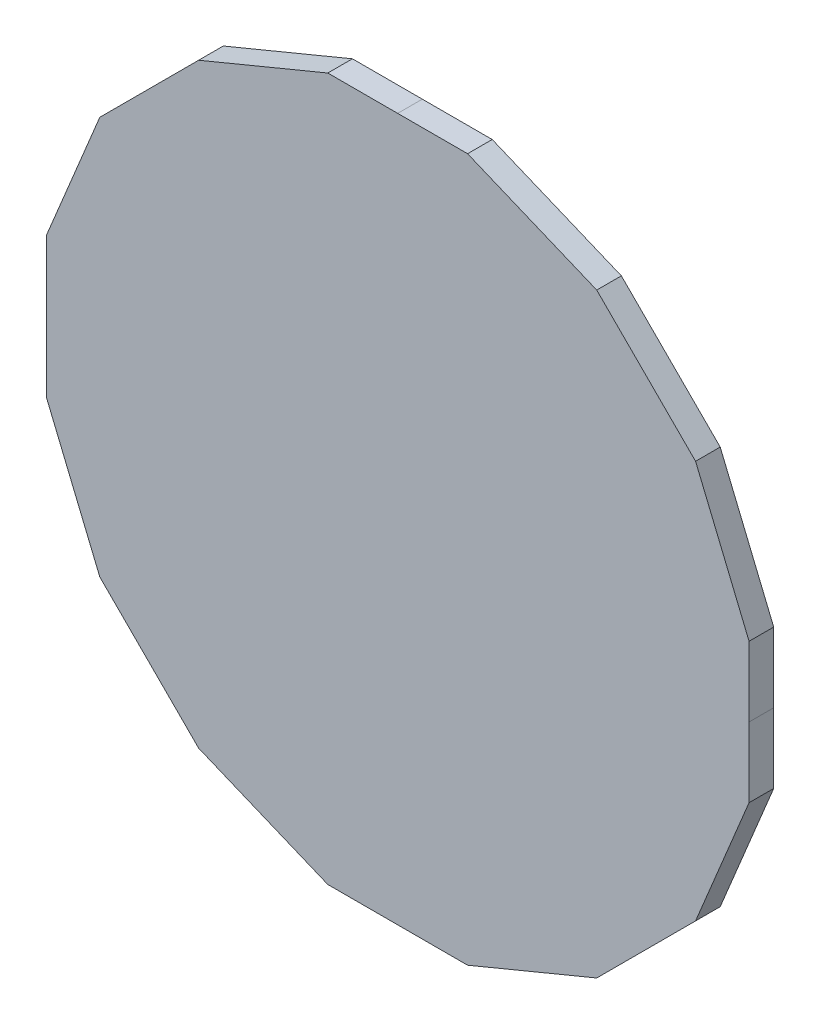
ISO-10303-21;
HEADER;
FILE_DESCRIPTION(('STEP AP214'),'2;1');
FILE_NAME('part.step','',(''),(''),'','','');
FILE_SCHEMA(('AUTOMOTIVE_DESIGN { 1 0 10303 214 1 1 1 1 }'));
ENDSEC;
DATA;
#1=APPLICATION_CONTEXT('core data for automotive mechanical design processes');
#2=APPLICATION_PROTOCOL_DEFINITION('international standard','automotive_design',2000,#1);
#3=PRODUCT_CONTEXT('',#1,'mechanical');
#4=PRODUCT('Part','Part','',(#3));
#5=PRODUCT_RELATED_PRODUCT_CATEGORY('part','',(#4));
#6=PRODUCT_DEFINITION_FORMATION('','',#4);
#7=PRODUCT_DEFINITION_CONTEXT('part definition',#1,'design');
#8=PRODUCT_DEFINITION('design','',#6,#7);
#9=PRODUCT_DEFINITION_SHAPE('','',#8);
#10=(LENGTH_UNIT() NAMED_UNIT(*) SI_UNIT(.MILLI.,.METRE.));
#11=(NAMED_UNIT(*) PLANE_ANGLE_UNIT() SI_UNIT($,.RADIAN.));
#12=(NAMED_UNIT(*) SI_UNIT($,.STERADIAN.) SOLID_ANGLE_UNIT());
#13=UNCERTAINTY_MEASURE_WITH_UNIT(LENGTH_MEASURE(1.E-05),#10,'distance_accuracy_value','');
#14=(GEOMETRIC_REPRESENTATION_CONTEXT(3) GLOBAL_UNCERTAINTY_ASSIGNED_CONTEXT((#13)) GLOBAL_UNIT_ASSIGNED_CONTEXT((#10,
#11,#12)) REPRESENTATION_CONTEXT('',''));
#15=CARTESIAN_POINT('',(0.,0.,0.));
#16=DIRECTION('',(0.,0.,1.));
#17=DIRECTION('',(1.,0.,0.));
#18=AXIS2_PLACEMENT_3D('',#15,#16,#17);
#19=CARTESIAN_POINT('',(-6.703281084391E-07,-6.703280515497E-07,0.0350012));
#20=DIRECTION('',(0.,0.,1.));
#21=DIRECTION('',(1.,0.,0.));
#22=AXIS2_PLACEMENT_3D('',#19,#20,#21);
#23=PLANE('',#22);
#24=DIRECTION('',(0.,-1.,0.));
#25=VECTOR('',#24,1.);
#26=CARTESIAN_POINT('',(-0.499491,0.,0.0350012));
#27=LINE('',#26,#25);
#28=CARTESIAN_POINT('',(-0.499491,0.,0.0350012));
#29=VERTEX_POINT('',#28);
#30=CARTESIAN_POINT('',(-0.499491,-0.09935717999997,0.0350012));
#31=VERTEX_POINT('',#30);
#32=EDGE_CURVE('E166',#29,#31,#27,.T.);
#33=ORIENTED_EDGE('',*,*,#32,.T.);
#34=DIRECTION('',(0.382682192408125,-0.923880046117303,0.));
#35=VECTOR('',#34,1.);
#36=CARTESIAN_POINT('',(-0.499491,-0.09935717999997,0.0350012));
#37=LINE('',#36,#35);
#38=CARTESIAN_POINT('',(-0.42344848,-0.28294076,0.0350012));
#39=VERTEX_POINT('',#38);
#40=EDGE_CURVE('E183',#31,#39,#37,.T.);
#41=ORIENTED_EDGE('',*,*,#40,.T.);
#42=DIRECTION('',(0.707106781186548,-0.707106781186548,0.));
#43=VECTOR('',#42,1.);
#44=CARTESIAN_POINT('',(-0.42344848,-0.28294076,0.0350012));
#45=LINE('',#44,#43);
#46=CARTESIAN_POINT('',(-0.28294076,-0.42344848,0.0350012));
#47=VERTEX_POINT('',#46);
#48=EDGE_CURVE('E245',#39,#47,#45,.T.);
#49=ORIENTED_EDGE('',*,*,#48,.T.);
#50=DIRECTION('',(0.923880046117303,-0.382682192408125,0.));
#51=VECTOR('',#50,1.);
#52=CARTESIAN_POINT('',(-0.28294076,-0.42344848,0.0350012));
#53=LINE('',#52,#51);
#54=CARTESIAN_POINT('',(-0.09935718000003,-0.499491,0.0350012));
#55=VERTEX_POINT('',#54);
#56=EDGE_CURVE('E188',#47,#55,#53,.T.);
#57=ORIENTED_EDGE('',*,*,#56,.T.);
#58=DIRECTION('',(1.,0.,0.));
#59=VECTOR('',#58,1.);
#60=CARTESIAN_POINT('',(-0.09935718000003,-0.499491,0.0350012));
#61=LINE('',#60,#59);
#62=CARTESIAN_POINT('',(0.,-0.499491,0.0350012));
#63=VERTEX_POINT('',#62);
#64=EDGE_CURVE('E258',#55,#63,#61,.T.);
#65=ORIENTED_EDGE('',*,*,#64,.T.);
#66=DIRECTION('',(1.,0.,0.));
#67=VECTOR('',#66,1.);
#68=CARTESIAN_POINT('',(0.,-0.499491,0.0350012));
#69=LINE('',#68,#67);
#70=CARTESIAN_POINT('',(0.09935463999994,-0.499491,0.0350012));
#71=VERTEX_POINT('',#70);
#72=EDGE_CURVE('E217',#63,#71,#69,.T.);
#73=ORIENTED_EDGE('',*,*,#72,.T.);
#74=DIRECTION('',(0.923880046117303,0.382682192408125,0.));
#75=VECTOR('',#74,1.);
#76=CARTESIAN_POINT('',(0.09935463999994,-0.499491,0.0350012));
#77=LINE('',#76,#75);
#78=CARTESIAN_POINT('',(0.28293822,-0.42344848,0.0350012));
#79=VERTEX_POINT('',#78);
#80=EDGE_CURVE('E200',#71,#79,#77,.T.);
#81=ORIENTED_EDGE('',*,*,#80,.T.);
#82=DIRECTION('',(0.707106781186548,0.707106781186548,0.));
#83=VECTOR('',#82,1.);
#84=CARTESIAN_POINT('',(0.28293822,-0.42344848,0.0350012));
#85=LINE('',#84,#83);
#86=CARTESIAN_POINT('',(0.42344594,-0.28294076,0.0350012));
#87=VERTEX_POINT('',#86);
#88=EDGE_CURVE('E288',#79,#87,#85,.T.);
#89=ORIENTED_EDGE('',*,*,#88,.T.);
#90=DIRECTION('',(0.382693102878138,0.923875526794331,0.));
#91=VECTOR('',#90,1.);
#92=CARTESIAN_POINT('',(0.42344594,-0.28294076,0.0350012));
#93=LINE('',#92,#91);
#94=CARTESIAN_POINT('',(0.499491,-0.09935717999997,0.0350012));
#95=VERTEX_POINT('',#94);
#96=EDGE_CURVE('E266',#87,#95,#93,.T.);
#97=ORIENTED_EDGE('',*,*,#96,.T.);
#98=DIRECTION('',(0.,1.,0.));
#99=VECTOR('',#98,1.);
#100=CARTESIAN_POINT('',(0.499491,-0.09935717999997,0.0350012));
#101=LINE('',#100,#99);
#102=CARTESIAN_POINT('',(0.499491,0.,0.0350012));
#103=VERTEX_POINT('',#102);
#104=EDGE_CURVE('E195',#95,#103,#101,.T.);
#105=ORIENTED_EDGE('',*,*,#104,.T.);
#106=DIRECTION('',(0.,1.,0.));
#107=VECTOR('',#106,1.);
#108=CARTESIAN_POINT('',(0.499491,0.,0.0350012));
#109=LINE('',#108,#107);
#110=CARTESIAN_POINT('',(0.499491,0.09935464,0.0350012));
#111=VERTEX_POINT('',#110);
#112=EDGE_CURVE('E213',#103,#111,#109,.T.);
#113=ORIENTED_EDGE('',*,*,#112,.T.);
#114=DIRECTION('',(-0.382693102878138,0.923875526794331,0.));
#115=VECTOR('',#114,1.);
#116=CARTESIAN_POINT('',(0.499491,0.09935464,0.0350012));
#117=LINE('',#116,#115);
#118=CARTESIAN_POINT('',(0.42344594,0.28293822,0.0350012));
#119=VERTEX_POINT('',#118);
#120=EDGE_CURVE('E314',#111,#119,#117,.T.);
#121=ORIENTED_EDGE('',*,*,#120,.T.);
#122=DIRECTION('',(-0.707106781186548,0.707106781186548,0.));
#123=VECTOR('',#122,1.);
#124=CARTESIAN_POINT('',(0.42344594,0.28293822,0.0350012));
#125=LINE('',#124,#123);
#126=CARTESIAN_POINT('',(0.28293822,0.42344594,0.0350012));
#127=VERTEX_POINT('',#126);
#128=EDGE_CURVE('E326',#119,#127,#125,.T.);
#129=ORIENTED_EDGE('',*,*,#128,.T.);
#130=DIRECTION('',(-0.923875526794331,0.382693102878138,0.));
#131=VECTOR('',#130,1.);
#132=CARTESIAN_POINT('',(0.28293822,0.42344594,0.0350012));
#133=LINE('',#132,#131);
#134=CARTESIAN_POINT('',(0.09935463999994,0.499491,0.0350012));
#135=VERTEX_POINT('',#134);
#136=EDGE_CURVE('E225',#127,#135,#133,.T.);
#137=ORIENTED_EDGE('',*,*,#136,.T.);
#138=DIRECTION('',(-1.,0.,0.));
#139=VECTOR('',#138,1.);
#140=CARTESIAN_POINT('',(0.09935463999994,0.499491,0.0350012));
#141=LINE('',#140,#139);
#142=CARTESIAN_POINT('',(0.,0.499491,0.0350012));
#143=VERTEX_POINT('',#142);
#144=EDGE_CURVE('E344',#135,#143,#141,.T.);
#145=ORIENTED_EDGE('',*,*,#144,.T.);
#146=DIRECTION('',(-1.,0.,0.));
#147=VECTOR('',#146,1.);
#148=CARTESIAN_POINT('',(0.,0.499491,0.0350012));
#149=LINE('',#148,#147);
#150=CARTESIAN_POINT('',(-0.09935718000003,0.499491,0.0350012));
#151=VERTEX_POINT('',#150);
#152=EDGE_CURVE('E356',#143,#151,#149,.T.);
#153=ORIENTED_EDGE('',*,*,#152,.T.);
#154=DIRECTION('',(-0.923875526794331,-0.382693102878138,0.));
#155=VECTOR('',#154,1.);
#156=CARTESIAN_POINT('',(-0.09935718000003,0.499491,0.0350012));
#157=LINE('',#156,#155);
#158=CARTESIAN_POINT('',(-0.28294076,0.42344594,0.0350012));
#159=VERTEX_POINT('',#158);
#160=EDGE_CURVE('E125',#151,#159,#157,.T.);
#161=ORIENTED_EDGE('',*,*,#160,.T.);
#162=DIRECTION('',(-0.707106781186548,-0.707106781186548,0.));
#163=VECTOR('',#162,1.);
#164=CARTESIAN_POINT('',(-0.28294076,0.42344594,0.0350012));
#165=LINE('',#164,#163);
#166=CARTESIAN_POINT('',(-0.42344848,0.28293822,0.0350012));
#167=VERTEX_POINT('',#166);
#168=EDGE_CURVE('E122',#159,#167,#165,.T.);
#169=ORIENTED_EDGE('',*,*,#168,.T.);
#170=DIRECTION('',(-0.382682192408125,-0.923880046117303,0.));
#171=VECTOR('',#170,1.);
#172=CARTESIAN_POINT('',(-0.42344848,0.28293822,0.0350012));
#173=LINE('',#172,#171);
#174=CARTESIAN_POINT('',(-0.499491,0.09935464,0.0350012));
#175=VERTEX_POINT('',#174);
#176=EDGE_CURVE('E110',#167,#175,#173,.T.);
#177=ORIENTED_EDGE('',*,*,#176,.T.);
#178=DIRECTION('',(0.,-1.,0.));
#179=VECTOR('',#178,1.);
#180=CARTESIAN_POINT('',(-0.499491,0.09935464,0.0350012));
#181=LINE('',#180,#179);
#182=EDGE_CURVE('E11',#175,#29,#181,.T.);
#183=ORIENTED_EDGE('',*,*,#182,.T.);
#184=EDGE_LOOP('',(#33,#41,#49,#57,#65,#73,#81,#89,#97,#105,#113,#121,#129,#137,#145,#153,#161,
#169,#177,#183));
#185=FACE_BOUND('',#184,.T.);
#186=ADVANCED_FACE('F17',(#185),#23,.T.);
#187=CARTESIAN_POINT('',(-6.703281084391E-07,-6.703280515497E-07,0.));
#188=DIRECTION('',(0.,0.,1.));
#189=DIRECTION('',(1.,0.,0.));
#190=AXIS2_PLACEMENT_3D('',#187,#188,#189);
#191=PLANE('',#190);
#192=DIRECTION('',(0.,-1.,0.));
#193=VECTOR('',#192,1.);
#194=CARTESIAN_POINT('',(-0.499491,0.09935464,0.));
#195=LINE('',#194,#193);
#196=CARTESIAN_POINT('',(-0.499491,0.09935464,0.));
#197=VERTEX_POINT('',#196);
#198=CARTESIAN_POINT('',(-0.499491,0.,0.));
#199=VERTEX_POINT('',#198);
#200=EDGE_CURVE('E27',#197,#199,#195,.T.);
#201=ORIENTED_EDGE('',*,*,#200,.F.);
#202=DIRECTION('',(-0.382682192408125,-0.923880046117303,0.));
#203=VECTOR('',#202,1.);
#204=CARTESIAN_POINT('',(-0.42344848,0.28293822,0.));
#205=LINE('',#204,#203);
#206=CARTESIAN_POINT('',(-0.42344848,0.28293822,0.));
#207=VERTEX_POINT('',#206);
#208=EDGE_CURVE('E130',#207,#197,#205,.T.);
#209=ORIENTED_EDGE('',*,*,#208,.F.);
#210=DIRECTION('',(-0.707106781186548,-0.707106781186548,0.));
#211=VECTOR('',#210,1.);
#212=CARTESIAN_POINT('',(-0.28294076,0.42344594,0.));
#213=LINE('',#212,#211);
#214=CARTESIAN_POINT('',(-0.28294076,0.42344594,0.));
#215=VERTEX_POINT('',#214);
#216=EDGE_CURVE('E133',#215,#207,#213,.T.);
#217=ORIENTED_EDGE('',*,*,#216,.F.);
#218=DIRECTION('',(-0.923875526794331,-0.382693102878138,0.));
#219=VECTOR('',#218,1.);
#220=CARTESIAN_POINT('',(-0.09935718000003,0.499491,0.));
#221=LINE('',#220,#219);
#222=CARTESIAN_POINT('',(-0.09935718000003,0.499491,0.));
#223=VERTEX_POINT('',#222);
#224=EDGE_CURVE('E359',#223,#215,#221,.T.);
#225=ORIENTED_EDGE('',*,*,#224,.F.);
#226=DIRECTION('',(-1.,0.,0.));
#227=VECTOR('',#226,1.);
#228=CARTESIAN_POINT('',(0.,0.499491,0.));
#229=LINE('',#228,#227);
#230=CARTESIAN_POINT('',(0.,0.499491,0.));
#231=VERTEX_POINT('',#230);
#232=EDGE_CURVE('E348',#231,#223,#229,.T.);
#233=ORIENTED_EDGE('',*,*,#232,.F.);
#234=DIRECTION('',(-1.,0.,0.));
#235=VECTOR('',#234,1.);
#236=CARTESIAN_POINT('',(0.09935463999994,0.499491,0.));
#237=LINE('',#236,#235);
#238=CARTESIAN_POINT('',(0.09935463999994,0.499491,0.));
#239=VERTEX_POINT('',#238);
#240=EDGE_CURVE('E220',#239,#231,#237,.T.);
#241=ORIENTED_EDGE('',*,*,#240,.F.);
#242=DIRECTION('',(-0.923875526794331,0.382693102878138,0.));
#243=VECTOR('',#242,1.);
#244=CARTESIAN_POINT('',(0.28293822,0.42344594,0.));
#245=LINE('',#244,#243);
#246=CARTESIAN_POINT('',(0.28293822,0.42344594,0.));
#247=VERTEX_POINT('',#246);
#248=EDGE_CURVE('E330',#247,#239,#245,.T.);
#249=ORIENTED_EDGE('',*,*,#248,.F.);
#250=DIRECTION('',(-0.707106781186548,0.707106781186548,0.));
#251=VECTOR('',#250,1.);
#252=CARTESIAN_POINT('',(0.42344594,0.28293822,0.));
#253=LINE('',#252,#251);
#254=CARTESIAN_POINT('',(0.42344594,0.28293822,0.));
#255=VERTEX_POINT('',#254);
#256=EDGE_CURVE('E318',#255,#247,#253,.T.);
#257=ORIENTED_EDGE('',*,*,#256,.F.);
#258=DIRECTION('',(-0.382693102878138,0.923875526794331,0.));
#259=VECTOR('',#258,1.);
#260=CARTESIAN_POINT('',(0.499491,0.09935464,0.));
#261=LINE('',#260,#259);
#262=CARTESIAN_POINT('',(0.499491,0.09935464,0.));
#263=VERTEX_POINT('',#262);
#264=EDGE_CURVE('E208',#263,#255,#261,.T.);
#265=ORIENTED_EDGE('',*,*,#264,.F.);
#266=DIRECTION('',(0.,1.,0.));
#267=VECTOR('',#266,1.);
#268=CARTESIAN_POINT('',(0.499491,0.,0.));
#269=LINE('',#268,#267);
#270=CARTESIAN_POINT('',(0.499491,0.,0.));
#271=VERTEX_POINT('',#270);
#272=EDGE_CURVE('E190',#271,#263,#269,.T.);
#273=ORIENTED_EDGE('',*,*,#272,.F.);
#274=DIRECTION('',(0.,1.,0.));
#275=VECTOR('',#274,1.);
#276=CARTESIAN_POINT('',(0.499491,-0.09935717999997,0.));
#277=LINE('',#276,#275);
#278=CARTESIAN_POINT('',(0.499491,-0.09935717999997,0.));
#279=VERTEX_POINT('',#278);
#280=EDGE_CURVE('E298',#279,#271,#277,.T.);
#281=ORIENTED_EDGE('',*,*,#280,.F.);
#282=DIRECTION('',(0.382693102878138,0.923875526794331,0.));
#283=VECTOR('',#282,1.);
#284=CARTESIAN_POINT('',(0.42344594,-0.28294076,0.));
#285=LINE('',#284,#283);
#286=CARTESIAN_POINT('',(0.42344594,-0.28294076,0.));
#287=VERTEX_POINT('',#286);
#288=EDGE_CURVE('E267',#287,#279,#285,.T.);
#289=ORIENTED_EDGE('',*,*,#288,.F.);
#290=DIRECTION('',(0.707106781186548,0.707106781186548,0.));
#291=VECTOR('',#290,1.);
#292=CARTESIAN_POINT('',(0.28293822,-0.42344848,0.));
#293=LINE('',#292,#291);
#294=CARTESIAN_POINT('',(0.28293822,-0.42344848,0.));
#295=VERTEX_POINT('',#294);
#296=EDGE_CURVE('E204',#295,#287,#293,.T.);
#297=ORIENTED_EDGE('',*,*,#296,.F.);
#298=DIRECTION('',(0.923880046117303,0.382682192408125,0.));
#299=VECTOR('',#298,1.);
#300=CARTESIAN_POINT('',(0.09935463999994,-0.499491,0.));
#301=LINE('',#300,#299);
#302=CARTESIAN_POINT('',(0.09935463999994,-0.499491,0.));
#303=VERTEX_POINT('',#302);
#304=EDGE_CURVE('E274',#303,#295,#301,.T.);
#305=ORIENTED_EDGE('',*,*,#304,.F.);
#306=DIRECTION('',(1.,0.,0.));
#307=VECTOR('',#306,1.);
#308=CARTESIAN_POINT('',(0.,-0.499491,0.));
#309=LINE('',#308,#307);
#310=CARTESIAN_POINT('',(0.,-0.499491,0.));
#311=VERTEX_POINT('',#310);
#312=EDGE_CURVE('E218',#311,#303,#309,.T.);
#313=ORIENTED_EDGE('',*,*,#312,.F.);
#314=DIRECTION('',(1.,0.,0.));
#315=VECTOR('',#314,1.);
#316=CARTESIAN_POINT('',(-0.09935718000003,-0.499491,0.));
#317=LINE('',#316,#315);
#318=CARTESIAN_POINT('',(-0.09935718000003,-0.499491,0.));
#319=VERTEX_POINT('',#318);
#320=EDGE_CURVE('E226',#319,#311,#317,.T.);
#321=ORIENTED_EDGE('',*,*,#320,.F.);
#322=DIRECTION('',(0.923880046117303,-0.382682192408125,0.));
#323=VECTOR('',#322,1.);
#324=CARTESIAN_POINT('',(-0.28294076,-0.42344848,0.));
#325=LINE('',#324,#323);
#326=CARTESIAN_POINT('',(-0.28294076,-0.42344848,0.));
#327=VERTEX_POINT('',#326);
#328=EDGE_CURVE('E189',#327,#319,#325,.T.);
#329=ORIENTED_EDGE('',*,*,#328,.F.);
#330=DIRECTION('',(0.707106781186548,-0.707106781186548,0.));
#331=VECTOR('',#330,1.);
#332=CARTESIAN_POINT('',(-0.42344848,-0.28294076,0.));
#333=LINE('',#332,#331);
#334=CARTESIAN_POINT('',(-0.42344848,-0.28294076,0.));
#335=VERTEX_POINT('',#334);
#336=EDGE_CURVE('E237',#335,#327,#333,.T.);
#337=ORIENTED_EDGE('',*,*,#336,.F.);
#338=DIRECTION('',(0.382682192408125,-0.923880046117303,0.));
#339=VECTOR('',#338,1.);
#340=CARTESIAN_POINT('',(-0.499491,-0.09935717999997,0.));
#341=LINE('',#340,#339);
#342=CARTESIAN_POINT('',(-0.499491,-0.09935717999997,0.));
#343=VERTEX_POINT('',#342);
#344=EDGE_CURVE('E168',#343,#335,#341,.T.);
#345=ORIENTED_EDGE('',*,*,#344,.F.);
#346=DIRECTION('',(0.,-1.,0.));
#347=VECTOR('',#346,1.);
#348=CARTESIAN_POINT('',(-0.499491,0.,0.));
#349=LINE('',#348,#347);
#350=EDGE_CURVE('E165',#199,#343,#349,.T.);
#351=ORIENTED_EDGE('',*,*,#350,.F.);
#352=EDGE_LOOP('',(#201,#209,#217,#225,#233,#241,#249,#257,#265,#273,#281,#289,#297,#305,#313,
#321,#329,#337,#345,#351));
#353=FACE_BOUND('',#352,.T.);
#354=ADVANCED_FACE('F19',(#353),#191,.F.);
#355=CARTESIAN_POINT('',(-0.499491,0.09935464,0.));
#356=DIRECTION('',(1.,0.,0.));
#357=DIRECTION('',(0.,1.,0.));
#358=AXIS2_PLACEMENT_3D('',#355,#356,#357);
#359=PLANE('',#358);
#360=ORIENTED_EDGE('',*,*,#200,.T.);
#361=DIRECTION('',(0.,0.,1.));
#362=VECTOR('',#361,1.);
#363=CARTESIAN_POINT('',(-0.499491,0.,0.));
#364=LINE('',#363,#362);
#365=EDGE_CURVE('E154',#199,#29,#364,.T.);
#366=ORIENTED_EDGE('',*,*,#365,.T.);
#367=ORIENTED_EDGE('',*,*,#182,.F.);
#368=DIRECTION('',(0.,0.,1.));
#369=VECTOR('',#368,1.);
#370=CARTESIAN_POINT('',(-0.499491,0.09935464,0.));
#371=LINE('',#370,#369);
#372=EDGE_CURVE('E117',#197,#175,#371,.T.);
#373=ORIENTED_EDGE('',*,*,#372,.F.);
#374=EDGE_LOOP('',(#360,#366,#367,#373));
#375=FACE_BOUND('',#374,.T.);
#376=ADVANCED_FACE('F152',(#375),#359,.F.);
#377=CARTESIAN_POINT('',(-0.42344848,0.28293822,0.));
#378=DIRECTION('',(0.923880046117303,-0.382682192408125,0.));
#379=DIRECTION('',(0.,0.,-1.));
#380=AXIS2_PLACEMENT_3D('',#377,#378,#379);
#381=PLANE('',#380);
#382=ORIENTED_EDGE('',*,*,#208,.T.);
#383=ORIENTED_EDGE('',*,*,#372,.T.);
#384=ORIENTED_EDGE('',*,*,#176,.F.);
#385=DIRECTION('',(0.,0.,1.));
#386=VECTOR('',#385,1.);
#387=CARTESIAN_POINT('',(-0.42344848,0.28293822,0.));
#388=LINE('',#387,#386);
#389=EDGE_CURVE('E115',#207,#167,#388,.T.);
#390=ORIENTED_EDGE('',*,*,#389,.F.);
#391=EDGE_LOOP('',(#382,#383,#384,#390));
#392=FACE_BOUND('',#391,.T.);
#393=ADVANCED_FACE('F113',(#392),#381,.F.);
#394=CARTESIAN_POINT('',(-0.28294076,0.42344594,0.));
#395=DIRECTION('',(0.707106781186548,-0.707106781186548,0.));
#396=DIRECTION('',(0.,0.,-1.));
#397=AXIS2_PLACEMENT_3D('',#394,#395,#396);
#398=PLANE('',#397);
#399=ORIENTED_EDGE('',*,*,#216,.T.);
#400=ORIENTED_EDGE('',*,*,#389,.T.);
#401=ORIENTED_EDGE('',*,*,#168,.F.);
#402=DIRECTION('',(0.,0.,1.));
#403=VECTOR('',#402,1.);
#404=CARTESIAN_POINT('',(-0.28294076,0.42344594,0.));
#405=LINE('',#404,#403);
#406=EDGE_CURVE('E363',#215,#159,#405,.T.);
#407=ORIENTED_EDGE('',*,*,#406,.F.);
#408=EDGE_LOOP('',(#399,#400,#401,#407));
#409=FACE_BOUND('',#408,.T.);
#410=ADVANCED_FACE('F132',(#409),#398,.F.);
#411=CARTESIAN_POINT('',(-0.09935718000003,0.499491,0.));
#412=DIRECTION('',(0.382693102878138,-0.923875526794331,0.));
#413=DIRECTION('',(0.,0.,-1.));
#414=AXIS2_PLACEMENT_3D('',#411,#412,#413);
#415=PLANE('',#414);
#416=ORIENTED_EDGE('',*,*,#224,.T.);
#417=ORIENTED_EDGE('',*,*,#406,.T.);
#418=ORIENTED_EDGE('',*,*,#160,.F.);
#419=DIRECTION('',(0.,0.,1.));
#420=VECTOR('',#419,1.);
#421=CARTESIAN_POINT('',(-0.09935718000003,0.499491,0.));
#422=LINE('',#421,#420);
#423=EDGE_CURVE('E352',#223,#151,#422,.T.);
#424=ORIENTED_EDGE('',*,*,#423,.F.);
#425=EDGE_LOOP('',(#416,#417,#418,#424));
#426=FACE_BOUND('',#425,.T.);
#427=ADVANCED_FACE('F613',(#426),#415,.F.);
#428=CARTESIAN_POINT('',(0.,0.499491,0.));
#429=DIRECTION('',(0.,-1.,0.));
#430=DIRECTION('',(0.,0.,-1.));
#431=AXIS2_PLACEMENT_3D('',#428,#429,#430);
#432=PLANE('',#431);
#433=ORIENTED_EDGE('',*,*,#232,.T.);
#434=ORIENTED_EDGE('',*,*,#423,.T.);
#435=ORIENTED_EDGE('',*,*,#152,.F.);
#436=DIRECTION('',(0.,0.,1.));
#437=VECTOR('',#436,1.);
#438=CARTESIAN_POINT('',(0.,0.499491,0.));
#439=LINE('',#438,#437);
#440=EDGE_CURVE('E224',#231,#143,#439,.T.);
#441=ORIENTED_EDGE('',*,*,#440,.F.);
#442=EDGE_LOOP('',(#433,#434,#435,#441));
#443=FACE_BOUND('',#442,.T.);
#444=ADVANCED_FACE('F585',(#443),#432,.F.);
#445=CARTESIAN_POINT('',(0.09935463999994,0.499491,0.));
#446=DIRECTION('',(0.,-1.,0.));
#447=DIRECTION('',(0.,0.,-1.));
#448=AXIS2_PLACEMENT_3D('',#445,#446,#447);
#449=PLANE('',#448);
#450=ORIENTED_EDGE('',*,*,#240,.T.);
#451=ORIENTED_EDGE('',*,*,#440,.T.);
#452=ORIENTED_EDGE('',*,*,#144,.F.);
#453=DIRECTION('',(0.,0.,1.));
#454=VECTOR('',#453,1.);
#455=CARTESIAN_POINT('',(0.09935463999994,0.499491,0.));
#456=LINE('',#455,#454);
#457=EDGE_CURVE('E334',#239,#135,#456,.T.);
#458=ORIENTED_EDGE('',*,*,#457,.F.);
#459=EDGE_LOOP('',(#450,#451,#452,#458));
#460=FACE_BOUND('',#459,.T.);
#461=ADVANCED_FACE('F579',(#460),#449,.F.);
#462=CARTESIAN_POINT('',(0.28293822,0.42344594,0.));
#463=DIRECTION('',(-0.382693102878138,-0.923875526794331,0.));
#464=DIRECTION('',(-0.923875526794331,0.382693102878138,0.));
#465=AXIS2_PLACEMENT_3D('',#462,#463,#464);
#466=PLANE('',#465);
#467=ORIENTED_EDGE('',*,*,#248,.T.);
#468=ORIENTED_EDGE('',*,*,#457,.T.);
#469=ORIENTED_EDGE('',*,*,#136,.F.);
#470=DIRECTION('',(0.,0.,1.));
#471=VECTOR('',#470,1.);
#472=CARTESIAN_POINT('',(0.28293822,0.42344594,0.));
#473=LINE('',#472,#471);
#474=EDGE_CURVE('E322',#247,#127,#473,.T.);
#475=ORIENTED_EDGE('',*,*,#474,.F.);
#476=EDGE_LOOP('',(#467,#468,#469,#475));
#477=FACE_BOUND('',#476,.T.);
#478=ADVANCED_FACE('F584',(#477),#466,.F.);
#479=CARTESIAN_POINT('',(0.42344594,0.28293822,0.));
#480=DIRECTION('',(-0.707106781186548,-0.707106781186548,0.));
#481=DIRECTION('',(-0.707106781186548,0.707106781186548,0.));
#482=AXIS2_PLACEMENT_3D('',#479,#480,#481);
#483=PLANE('',#482);
#484=ORIENTED_EDGE('',*,*,#256,.T.);
#485=ORIENTED_EDGE('',*,*,#474,.T.);
#486=ORIENTED_EDGE('',*,*,#128,.F.);
#487=DIRECTION('',(0.,0.,1.));
#488=VECTOR('',#487,1.);
#489=CARTESIAN_POINT('',(0.42344594,0.28293822,0.));
#490=LINE('',#489,#488);
#491=EDGE_CURVE('E212',#255,#119,#490,.T.);
#492=ORIENTED_EDGE('',*,*,#491,.F.);
#493=EDGE_LOOP('',(#484,#485,#486,#492));
#494=FACE_BOUND('',#493,.T.);
#495=ADVANCED_FACE('F676',(#494),#483,.F.);
#496=CARTESIAN_POINT('',(0.499491,0.09935464,0.));
#497=DIRECTION('',(-0.923875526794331,-0.382693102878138,0.));
#498=DIRECTION('',(-0.382693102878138,0.923875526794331,0.));
#499=AXIS2_PLACEMENT_3D('',#496,#497,#498);
#500=PLANE('',#499);
#501=ORIENTED_EDGE('',*,*,#264,.T.);
#502=ORIENTED_EDGE('',*,*,#491,.T.);
#503=ORIENTED_EDGE('',*,*,#120,.F.);
#504=DIRECTION('',(0.,0.,1.));
#505=VECTOR('',#504,1.);
#506=CARTESIAN_POINT('',(0.499491,0.09935464,0.));
#507=LINE('',#506,#505);
#508=EDGE_CURVE('E194',#263,#111,#507,.T.);
#509=ORIENTED_EDGE('',*,*,#508,.F.);
#510=EDGE_LOOP('',(#501,#502,#503,#509));
#511=FACE_BOUND('',#510,.T.);
#512=ADVANCED_FACE('F643',(#511),#500,.F.);
#513=CARTESIAN_POINT('',(0.499491,0.,0.));
#514=DIRECTION('',(-1.,0.,0.));
#515=DIRECTION('',(0.,0.,1.));
#516=AXIS2_PLACEMENT_3D('',#513,#514,#515);
#517=PLANE('',#516);
#518=ORIENTED_EDGE('',*,*,#272,.T.);
#519=ORIENTED_EDGE('',*,*,#508,.T.);
#520=ORIENTED_EDGE('',*,*,#112,.F.);
#521=DIRECTION('',(0.,0.,1.));
#522=VECTOR('',#521,1.);
#523=CARTESIAN_POINT('',(0.499491,0.,0.));
#524=LINE('',#523,#522);
#525=EDGE_CURVE('E198',#271,#103,#524,.T.);
#526=ORIENTED_EDGE('',*,*,#525,.F.);
#527=EDGE_LOOP('',(#518,#519,#520,#526));
#528=FACE_BOUND('',#527,.T.);
#529=ADVANCED_FACE('F637',(#528),#517,.F.);
#530=CARTESIAN_POINT('',(0.499491,-0.09935717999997,0.));
#531=DIRECTION('',(-1.,0.,0.));
#532=DIRECTION('',(0.,0.,1.));
#533=AXIS2_PLACEMENT_3D('',#530,#531,#532);
#534=PLANE('',#533);
#535=ORIENTED_EDGE('',*,*,#280,.T.);
#536=ORIENTED_EDGE('',*,*,#525,.T.);
#537=ORIENTED_EDGE('',*,*,#104,.F.);
#538=DIRECTION('',(0.,0.,1.));
#539=VECTOR('',#538,1.);
#540=CARTESIAN_POINT('',(0.499491,-0.09935717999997,0.));
#541=LINE('',#540,#539);
#542=EDGE_CURVE('E262',#279,#95,#541,.T.);
#543=ORIENTED_EDGE('',*,*,#542,.F.);
#544=EDGE_LOOP('',(#535,#536,#537,#543));
#545=FACE_BOUND('',#544,.T.);
#546=ADVANCED_FACE('F642',(#545),#534,.F.);
#547=CARTESIAN_POINT('',(0.42344594,-0.28294076,0.));
#548=DIRECTION('',(-0.923875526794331,0.382693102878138,0.));
#549=DIRECTION('',(0.,0.,1.));
#550=AXIS2_PLACEMENT_3D('',#547,#548,#549);
#551=PLANE('',#550);
#552=ORIENTED_EDGE('',*,*,#288,.T.);
#553=ORIENTED_EDGE('',*,*,#542,.T.);
#554=ORIENTED_EDGE('',*,*,#96,.F.);
#555=DIRECTION('',(0.,0.,1.));
#556=VECTOR('',#555,1.);
#557=CARTESIAN_POINT('',(0.42344594,-0.28294076,0.));
#558=LINE('',#557,#556);
#559=EDGE_CURVE('E284',#287,#87,#558,.T.);
#560=ORIENTED_EDGE('',*,*,#559,.F.);
#561=EDGE_LOOP('',(#552,#553,#554,#560));
#562=FACE_BOUND('',#561,.T.);
#563=ADVANCED_FACE('F653',(#562),#551,.F.);
#564=CARTESIAN_POINT('',(0.28293822,-0.42344848,0.));
#565=DIRECTION('',(-0.707106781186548,0.707106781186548,0.));
#566=DIRECTION('',(0.,0.,1.));
#567=AXIS2_PLACEMENT_3D('',#564,#565,#566);
#568=PLANE('',#567);
#569=ORIENTED_EDGE('',*,*,#296,.T.);
#570=ORIENTED_EDGE('',*,*,#559,.T.);
#571=ORIENTED_EDGE('',*,*,#88,.F.);
#572=DIRECTION('',(0.,0.,1.));
#573=VECTOR('',#572,1.);
#574=CARTESIAN_POINT('',(0.28293822,-0.42344848,0.));
#575=LINE('',#574,#573);
#576=EDGE_CURVE('E205',#295,#79,#575,.T.);
#577=ORIENTED_EDGE('',*,*,#576,.F.);
#578=EDGE_LOOP('',(#569,#570,#571,#577));
#579=FACE_BOUND('',#578,.T.);
#580=ADVANCED_FACE('F631',(#579),#568,.F.);
#581=CARTESIAN_POINT('',(0.09935463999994,-0.499491,0.));
#582=DIRECTION('',(-0.382682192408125,0.923880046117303,0.));
#583=DIRECTION('',(0.,0.,1.));
#584=AXIS2_PLACEMENT_3D('',#581,#582,#583);
#585=PLANE('',#584);
#586=ORIENTED_EDGE('',*,*,#304,.T.);
#587=ORIENTED_EDGE('',*,*,#576,.T.);
#588=ORIENTED_EDGE('',*,*,#80,.F.);
#589=DIRECTION('',(0.,0.,1.));
#590=VECTOR('',#589,1.);
#591=CARTESIAN_POINT('',(0.09935463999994,-0.499491,0.));
#592=LINE('',#591,#590);
#593=EDGE_CURVE('E214',#303,#71,#592,.T.);
#594=ORIENTED_EDGE('',*,*,#593,.F.);
#595=EDGE_LOOP('',(#586,#587,#588,#594));
#596=FACE_BOUND('',#595,.T.);
#597=ADVANCED_FACE('F622',(#596),#585,.F.);
#598=CARTESIAN_POINT('',(0.,-0.499491,0.));
#599=DIRECTION('',(0.,1.,0.));
#600=DIRECTION('',(1.,0.,0.));
#601=AXIS2_PLACEMENT_3D('',#598,#599,#600);
#602=PLANE('',#601);
#603=ORIENTED_EDGE('',*,*,#312,.T.);
#604=ORIENTED_EDGE('',*,*,#593,.T.);
#605=ORIENTED_EDGE('',*,*,#72,.F.);
#606=DIRECTION('',(0.,0.,1.));
#607=VECTOR('',#606,1.);
#608=CARTESIAN_POINT('',(0.,-0.499491,0.));
#609=LINE('',#608,#607);
#610=EDGE_CURVE('E230',#311,#63,#609,.T.);
#611=ORIENTED_EDGE('',*,*,#610,.F.);
#612=EDGE_LOOP('',(#603,#604,#605,#611));
#613=FACE_BOUND('',#612,.T.);
#614=ADVANCED_FACE('F604',(#613),#602,.F.);
#615=CARTESIAN_POINT('',(-0.09935718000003,-0.499491,0.));
#616=DIRECTION('',(0.,1.,0.));
#617=DIRECTION('',(1.,0.,0.));
#618=AXIS2_PLACEMENT_3D('',#615,#616,#617);
#619=PLANE('',#618);
#620=ORIENTED_EDGE('',*,*,#320,.T.);
#621=ORIENTED_EDGE('',*,*,#610,.T.);
#622=ORIENTED_EDGE('',*,*,#64,.F.);
#623=DIRECTION('',(0.,0.,1.));
#624=VECTOR('',#623,1.);
#625=CARTESIAN_POINT('',(-0.09935718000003,-0.499491,0.));
#626=LINE('',#625,#624);
#627=EDGE_CURVE('E184',#319,#55,#626,.T.);
#628=ORIENTED_EDGE('',*,*,#627,.F.);
#629=EDGE_LOOP('',(#620,#621,#622,#628));
#630=FACE_BOUND('',#629,.T.);
#631=ADVANCED_FACE('F595',(#630),#619,.F.);
#632=CARTESIAN_POINT('',(-0.28294076,-0.42344848,0.));
#633=DIRECTION('',(0.382682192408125,0.923880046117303,0.));
#634=DIRECTION('',(0.,0.,-1.));
#635=AXIS2_PLACEMENT_3D('',#632,#633,#634);
#636=PLANE('',#635);
#637=ORIENTED_EDGE('',*,*,#328,.T.);
#638=ORIENTED_EDGE('',*,*,#627,.T.);
#639=ORIENTED_EDGE('',*,*,#56,.F.);
#640=DIRECTION('',(0.,0.,1.));
#641=VECTOR('',#640,1.);
#642=CARTESIAN_POINT('',(-0.28294076,-0.42344848,0.));
#643=LINE('',#642,#641);
#644=EDGE_CURVE('E241',#327,#47,#643,.T.);
#645=ORIENTED_EDGE('',*,*,#644,.F.);
#646=EDGE_LOOP('',(#637,#638,#639,#645));
#647=FACE_BOUND('',#646,.T.);
#648=ADVANCED_FACE('F573',(#647),#636,.F.);
#649=CARTESIAN_POINT('',(-0.42344848,-0.28294076,0.));
#650=DIRECTION('',(0.707106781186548,0.707106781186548,0.));
#651=DIRECTION('',(0.,0.,-1.));
#652=AXIS2_PLACEMENT_3D('',#649,#650,#651);
#653=PLANE('',#652);
#654=ORIENTED_EDGE('',*,*,#336,.T.);
#655=ORIENTED_EDGE('',*,*,#644,.T.);
#656=ORIENTED_EDGE('',*,*,#48,.F.);
#657=DIRECTION('',(0.,0.,1.));
#658=VECTOR('',#657,1.);
#659=CARTESIAN_POINT('',(-0.42344848,-0.28294076,0.));
#660=LINE('',#659,#658);
#661=EDGE_CURVE('E233',#335,#39,#660,.T.);
#662=ORIENTED_EDGE('',*,*,#661,.F.);
#663=EDGE_LOOP('',(#654,#655,#656,#662));
#664=FACE_BOUND('',#663,.T.);
#665=ADVANCED_FACE('F564',(#664),#653,.F.);
#666=CARTESIAN_POINT('',(-0.499491,-0.09935717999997,0.));
#667=DIRECTION('',(0.923880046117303,0.382682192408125,0.));
#668=DIRECTION('',(0.,0.,-1.));
#669=AXIS2_PLACEMENT_3D('',#666,#667,#668);
#670=PLANE('',#669);
#671=ORIENTED_EDGE('',*,*,#344,.T.);
#672=ORIENTED_EDGE('',*,*,#661,.T.);
#673=ORIENTED_EDGE('',*,*,#40,.F.);
#674=DIRECTION('',(0.,0.,1.));
#675=VECTOR('',#674,1.);
#676=CARTESIAN_POINT('',(-0.499491,-0.09935717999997,0.));
#677=LINE('',#676,#675);
#678=EDGE_CURVE('E175',#343,#31,#677,.T.);
#679=ORIENTED_EDGE('',*,*,#678,.F.);
#680=EDGE_LOOP('',(#671,#672,#673,#679));
#681=FACE_BOUND('',#680,.T.);
#682=ADVANCED_FACE('F556',(#681),#670,.F.);
#683=CARTESIAN_POINT('',(-0.499491,0.,0.));
#684=DIRECTION('',(1.,0.,0.));
#685=DIRECTION('',(0.,1.,0.));
#686=AXIS2_PLACEMENT_3D('',#683,#684,#685);
#687=PLANE('',#686);
#688=ORIENTED_EDGE('',*,*,#350,.T.);
#689=ORIENTED_EDGE('',*,*,#678,.T.);
#690=ORIENTED_EDGE('',*,*,#32,.F.);
#691=ORIENTED_EDGE('',*,*,#365,.F.);
#692=EDGE_LOOP('',(#688,#689,#690,#691));
#693=FACE_BOUND('',#692,.T.);
#694=ADVANCED_FACE('F163',(#693),#687,.F.);
#695=CLOSED_SHELL('',(#186,#354,#376,#393,#410,#427,#444,#461,#478,#495,#512,#529,#546,#563,
#580,#597,#614,#631,#648,#665,#682,#694));
#696=MANIFOLD_SOLID_BREP('B1',#695);
#697=ADVANCED_BREP_SHAPE_REPRESENTATION('',(#18,#696),#14);
#698=SHAPE_DEFINITION_REPRESENTATION(#9,#697);
ENDSEC;
END-ISO-10303-21;
